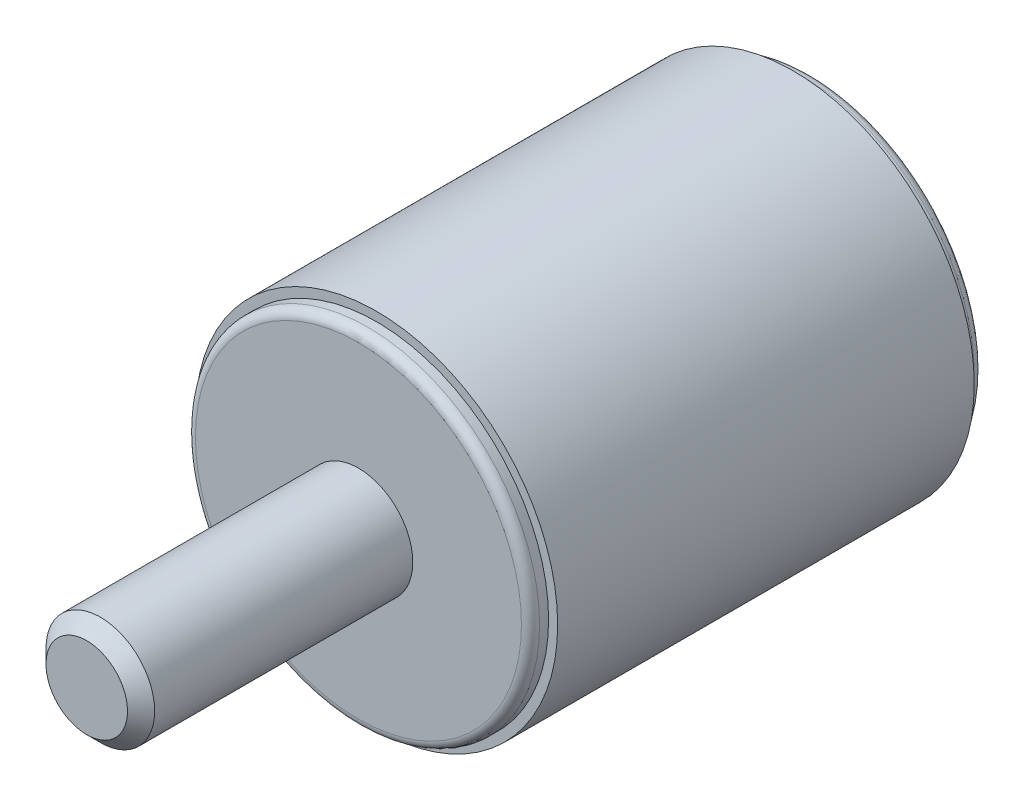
ISO-10303-21;
HEADER;
FILE_DESCRIPTION(('STEP AP214'),'2;1');
FILE_NAME('part.step','',(''),(''),'','','');
FILE_SCHEMA(('AUTOMOTIVE_DESIGN { 1 0 10303 214 1 1 1 1 }'));
ENDSEC;
DATA;
#1=APPLICATION_CONTEXT('core data for automotive mechanical design processes');
#2=APPLICATION_PROTOCOL_DEFINITION('international standard','automotive_design',2000,#1);
#3=PRODUCT_CONTEXT('',#1,'mechanical');
#4=PRODUCT('Part','Part','',(#3));
#5=PRODUCT_RELATED_PRODUCT_CATEGORY('part','',(#4));
#6=PRODUCT_DEFINITION_FORMATION('','',#4);
#7=PRODUCT_DEFINITION_CONTEXT('part definition',#1,'design');
#8=PRODUCT_DEFINITION('design','',#6,#7);
#9=PRODUCT_DEFINITION_SHAPE('','',#8);
#10=(LENGTH_UNIT() NAMED_UNIT(*) SI_UNIT(.MILLI.,.METRE.));
#11=(NAMED_UNIT(*) PLANE_ANGLE_UNIT() SI_UNIT($,.RADIAN.));
#12=(NAMED_UNIT(*) SI_UNIT($,.STERADIAN.) SOLID_ANGLE_UNIT());
#13=UNCERTAINTY_MEASURE_WITH_UNIT(LENGTH_MEASURE(1.E-05),#10,'distance_accuracy_value','');
#14=(GEOMETRIC_REPRESENTATION_CONTEXT(3) GLOBAL_UNCERTAINTY_ASSIGNED_CONTEXT((#13)) GLOBAL_UNIT_ASSIGNED_CONTEXT((#10,
#11,#12)) REPRESENTATION_CONTEXT('',''));
#15=CARTESIAN_POINT('',(0.,0.,0.));
#16=DIRECTION('',(0.,0.,1.));
#17=DIRECTION('',(1.,0.,0.));
#18=AXIS2_PLACEMENT_3D('',#15,#16,#17);
#19=CARTESIAN_POINT('',(0.,0.,24.));
#20=DIRECTION('',(0.,0.,1.));
#21=DIRECTION('',(1.,0.,0.));
#22=AXIS2_PLACEMENT_3D('',#19,#20,#21);
#23=PLANE('',#22);
#24=CARTESIAN_POINT('',(0.,0.,24.));
#25=DIRECTION('',(0.,0.,1.));
#26=DIRECTION('',(1.,0.,0.));
#27=AXIS2_PLACEMENT_3D('',#24,#25,#26);
#28=CIRCLE('',#27,9.);
#29=CARTESIAN_POINT('',(9.,0.,24.));
#30=VERTEX_POINT('',#29);
#31=EDGE_CURVE('E71',#30,#30,#28,.T.);
#32=ORIENTED_EDGE('',*,*,#31,.T.);
#33=EDGE_LOOP('',(#32));
#34=FACE_BOUND('',#33,.T.);
#35=CARTESIAN_POINT('',(0.,0.,24.));
#36=DIRECTION('',(0.,0.,1.));
#37=DIRECTION('',(1.,0.,0.));
#38=AXIS2_PLACEMENT_3D('',#35,#36,#37);
#39=CIRCLE('',#38,3.);
#40=CARTESIAN_POINT('',(3.,0.,24.));
#41=VERTEX_POINT('',#40);
#42=EDGE_CURVE('E48',#41,#41,#39,.T.);
#43=ORIENTED_EDGE('',*,*,#42,.F.);
#44=EDGE_LOOP('',(#43));
#45=FACE_BOUND('',#44,.T.);
#46=ADVANCED_FACE('F26',(#34,#45),#23,.T.);
#47=CARTESIAN_POINT('',(0.,0.,0.));
#48=DIRECTION('',(0.,0.,1.));
#49=DIRECTION('',(1.,0.,0.));
#50=AXIS2_PLACEMENT_3D('',#47,#48,#49);
#51=PLANE('',#50);
#52=CARTESIAN_POINT('',(0.,0.,0.));
#53=DIRECTION('',(0.,0.,1.));
#54=DIRECTION('',(1.,0.,0.));
#55=AXIS2_PLACEMENT_3D('',#52,#53,#54);
#56=CIRCLE('',#55,10.);
#57=CARTESIAN_POINT('',(10.,0.,0.));
#58=VERTEX_POINT('',#57);
#59=EDGE_CURVE('E56',#58,#58,#56,.T.);
#60=ORIENTED_EDGE('',*,*,#59,.F.);
#61=EDGE_LOOP('',(#60));
#62=FACE_BOUND('',#61,.T.);
#63=CARTESIAN_POINT('',(0.,0.,0.));
#64=DIRECTION('',(0.,0.,1.));
#65=DIRECTION('',(1.,0.,0.));
#66=AXIS2_PLACEMENT_3D('',#63,#64,#65);
#67=CIRCLE('',#66,9.5);
#68=CARTESIAN_POINT('',(9.5,0.,0.));
#69=VERTEX_POINT('',#68);
#70=EDGE_CURVE('E62',#69,#69,#67,.F.);
#71=ORIENTED_EDGE('',*,*,#70,.F.);
#72=EDGE_LOOP('',(#71));
#73=FACE_BOUND('',#72,.T.);
#74=ADVANCED_FACE('F95',(#62,#73),#51,.F.);
#75=CARTESIAN_POINT('',(0.,0.,23.));
#76=DIRECTION('',(0.,0.,1.));
#77=DIRECTION('',(1.,0.,0.));
#78=AXIS2_PLACEMENT_3D('',#75,#76,#77);
#79=PLANE('',#78);
#80=CARTESIAN_POINT('',(0.,0.,23.));
#81=DIRECTION('',(0.,0.,1.));
#82=DIRECTION('',(1.,0.,0.));
#83=AXIS2_PLACEMENT_3D('',#80,#81,#82);
#84=CIRCLE('',#83,10.);
#85=CARTESIAN_POINT('',(10.,0.,23.));
#86=VERTEX_POINT('',#85);
#87=EDGE_CURVE('E59',#86,#86,#84,.T.);
#88=ORIENTED_EDGE('',*,*,#87,.T.);
#89=EDGE_LOOP('',(#88));
#90=FACE_BOUND('',#89,.T.);
#91=CARTESIAN_POINT('',(0.,0.,23.));
#92=DIRECTION('',(0.,0.,1.));
#93=DIRECTION('',(1.,0.,0.));
#94=AXIS2_PLACEMENT_3D('',#91,#92,#93);
#95=CIRCLE('',#94,9.5);
#96=CARTESIAN_POINT('',(9.5,0.,23.));
#97=VERTEX_POINT('',#96);
#98=EDGE_CURVE('E53',#97,#97,#95,.T.);
#99=ORIENTED_EDGE('',*,*,#98,.F.);
#100=EDGE_LOOP('',(#99));
#101=FACE_BOUND('',#100,.T.);
#102=ADVANCED_FACE('F103',(#90,#101),#79,.T.);
#103=CARTESIAN_POINT('',(0.,0.,23.));
#104=DIRECTION('',(0.,0.,-1.));
#105=DIRECTION('',(-1.,0.,0.));
#106=AXIS2_PLACEMENT_3D('',#103,#104,#105);
#107=CYLINDRICAL_SURFACE('',#106,10.);
#108=ORIENTED_EDGE('',*,*,#87,.F.);
#109=EDGE_LOOP('',(#108));
#110=FACE_BOUND('',#109,.T.);
#111=ORIENTED_EDGE('',*,*,#59,.T.);
#112=EDGE_LOOP('',(#111));
#113=FACE_BOUND('',#112,.T.);
#114=ADVANCED_FACE('F28',(#110,#113),#107,.T.);
#115=CARTESIAN_POINT('',(0.,0.,24.));
#116=DIRECTION('',(0.,0.,-1.));
#117=DIRECTION('',(-1.,0.,0.));
#118=AXIS2_PLACEMENT_3D('',#115,#116,#117);
#119=CYLINDRICAL_SURFACE('',#118,9.5);
#120=CARTESIAN_POINT('',(0.,0.,23.5));
#121=DIRECTION('',(0.,0.,1.));
#122=DIRECTION('',(1.,0.,0.));
#123=AXIS2_PLACEMENT_3D('',#120,#121,#122);
#124=CIRCLE('',#123,9.5);
#125=CARTESIAN_POINT('',(9.5,0.,23.5));
#126=VERTEX_POINT('',#125);
#127=EDGE_CURVE('E74',#126,#126,#124,.F.);
#128=ORIENTED_EDGE('',*,*,#127,.T.);
#129=EDGE_LOOP('',(#128));
#130=FACE_BOUND('',#129,.T.);
#131=ORIENTED_EDGE('',*,*,#98,.T.);
#132=EDGE_LOOP('',(#131));
#133=FACE_BOUND('',#132,.T.);
#134=ADVANCED_FACE('F111',(#130,#133),#119,.T.);
#135=CARTESIAN_POINT('',(0.,0.,-1.));
#136=DIRECTION('',(0.,0.,1.));
#137=DIRECTION('',(1.,0.,0.));
#138=AXIS2_PLACEMENT_3D('',#135,#136,#137);
#139=CYLINDRICAL_SURFACE('',#138,9.5);
#140=CARTESIAN_POINT('',(0.,0.,-0.5));
#141=DIRECTION('',(0.,0.,-1.));
#142=DIRECTION('',(-1.,0.,0.));
#143=AXIS2_PLACEMENT_3D('',#140,#141,#142);
#144=CIRCLE('',#143,9.5);
#145=CARTESIAN_POINT('',(-9.5,0.,-0.5));
#146=VERTEX_POINT('',#145);
#147=EDGE_CURVE('E68',#146,#146,#144,.F.);
#148=ORIENTED_EDGE('',*,*,#147,.T.);
#149=EDGE_LOOP('',(#148));
#150=FACE_BOUND('',#149,.T.);
#151=ORIENTED_EDGE('',*,*,#70,.T.);
#152=EDGE_LOOP('',(#151));
#153=FACE_BOUND('',#152,.T.);
#154=ADVANCED_FACE('F109',(#150,#153),#139,.T.);
#155=CARTESIAN_POINT('',(0.,0.,-1.));
#156=DIRECTION('',(0.,0.,-1.));
#157=DIRECTION('',(-1.,0.,0.));
#158=AXIS2_PLACEMENT_3D('',#155,#156,#157);
#159=PLANE('',#158);
#160=CARTESIAN_POINT('',(0.,0.,-1.));
#161=DIRECTION('',(0.,0.,-1.));
#162=DIRECTION('',(-1.,0.,0.));
#163=AXIS2_PLACEMENT_3D('',#160,#161,#162);
#164=CIRCLE('',#163,3.);
#165=CARTESIAN_POINT('',(-3.,0.,-1.));
#166=VERTEX_POINT('',#165);
#167=EDGE_CURVE('E45',#166,#166,#164,.T.);
#168=ORIENTED_EDGE('',*,*,#167,.F.);
#169=EDGE_LOOP('',(#168));
#170=FACE_BOUND('',#169,.T.);
#171=CARTESIAN_POINT('',(0.,0.,-1.));
#172=DIRECTION('',(0.,0.,-1.));
#173=DIRECTION('',(-1.,0.,0.));
#174=AXIS2_PLACEMENT_3D('',#171,#172,#173);
#175=CIRCLE('',#174,9.);
#176=CARTESIAN_POINT('',(-9.,0.,-1.));
#177=VERTEX_POINT('',#176);
#178=EDGE_CURVE('E65',#177,#177,#175,.T.);
#179=ORIENTED_EDGE('',*,*,#178,.T.);
#180=EDGE_LOOP('',(#179));
#181=FACE_BOUND('',#180,.T.);
#182=ADVANCED_FACE('F130',(#170,#181),#159,.T.);
#183=CARTESIAN_POINT('',(0.,0.,-0.5));
#184=DIRECTION('',(0.,0.,-1.));
#185=DIRECTION('',(-1.,0.,0.));
#186=AXIS2_PLACEMENT_3D('',#183,#184,#185);
#187=TOROIDAL_SURFACE('',#186,9.,0.5);
#188=ORIENTED_EDGE('',*,*,#147,.F.);
#189=EDGE_LOOP('',(#188));
#190=FACE_BOUND('',#189,.T.);
#191=ORIENTED_EDGE('',*,*,#178,.F.);
#192=EDGE_LOOP('',(#191));
#193=FACE_BOUND('',#192,.T.);
#194=ADVANCED_FACE('F135',(#190,#193),#187,.T.);
#195=CARTESIAN_POINT('',(0.,0.,23.5));
#196=DIRECTION('',(0.,0.,1.));
#197=DIRECTION('',(1.,0.,0.));
#198=AXIS2_PLACEMENT_3D('',#195,#196,#197);
#199=TOROIDAL_SURFACE('',#198,9.,0.5);
#200=ORIENTED_EDGE('',*,*,#127,.F.);
#201=EDGE_LOOP('',(#200));
#202=FACE_BOUND('',#201,.T.);
#203=ORIENTED_EDGE('',*,*,#31,.F.);
#204=EDGE_LOOP('',(#203));
#205=FACE_BOUND('',#204,.T.);
#206=ADVANCED_FACE('F140',(#202,#205),#199,.T.);
#207=CARTESIAN_POINT('',(0.,0.,39.));
#208=DIRECTION('',(0.,0.,-1.));
#209=DIRECTION('',(-1.,0.,0.));
#210=AXIS2_PLACEMENT_3D('',#207,#208,#209);
#211=CYLINDRICAL_SURFACE('',#210,3.);
#212=CARTESIAN_POINT('',(0.,0.,38.25));
#213=DIRECTION('',(0.,0.,1.));
#214=DIRECTION('',(1.,0.,0.));
#215=AXIS2_PLACEMENT_3D('',#212,#213,#214);
#216=CIRCLE('',#215,3.);
#217=CARTESIAN_POINT('',(3.,0.,38.25));
#218=VERTEX_POINT('',#217);
#219=EDGE_CURVE('E11',#218,#218,#216,.F.);
#220=ORIENTED_EDGE('',*,*,#219,.T.);
#221=EDGE_LOOP('',(#220));
#222=FACE_BOUND('',#221,.T.);
#223=ORIENTED_EDGE('',*,*,#42,.T.);
#224=EDGE_LOOP('',(#223));
#225=FACE_BOUND('',#224,.T.);
#226=ADVANCED_FACE('F91',(#222,#225),#211,.T.);
#227=CARTESIAN_POINT('',(0.,0.,39.));
#228=DIRECTION('',(0.,0.,1.));
#229=DIRECTION('',(1.,0.,0.));
#230=AXIS2_PLACEMENT_3D('',#227,#228,#229);
#231=PLANE('',#230);
#232=CARTESIAN_POINT('',(0.,0.,39.));
#233=DIRECTION('',(0.,0.,1.));
#234=DIRECTION('',(1.,0.,0.));
#235=AXIS2_PLACEMENT_3D('',#232,#233,#234);
#236=CIRCLE('',#235,2.25);
#237=CARTESIAN_POINT('',(2.25,0.,39.));
#238=VERTEX_POINT('',#237);
#239=EDGE_CURVE('E33',#238,#238,#236,.T.);
#240=ORIENTED_EDGE('',*,*,#239,.T.);
#241=EDGE_LOOP('',(#240));
#242=FACE_BOUND('',#241,.T.);
#243=ADVANCED_FACE('F79',(#242),#231,.T.);
#244=CARTESIAN_POINT('',(0.,0.,39.));
#245=DIRECTION('',(0.,0.,-1.));
#246=DIRECTION('',(-1.,0.,0.));
#247=AXIS2_PLACEMENT_3D('',#244,#245,#246);
#248=CONICAL_SURFACE('',#247,2.25,0.785398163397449);
#249=ORIENTED_EDGE('',*,*,#219,.F.);
#250=EDGE_LOOP('',(#249));
#251=FACE_BOUND('',#250,.T.);
#252=ORIENTED_EDGE('',*,*,#239,.F.);
#253=EDGE_LOOP('',(#252));
#254=FACE_BOUND('',#253,.T.);
#255=ADVANCED_FACE('F81',(#251,#254),#248,.T.);
#256=CARTESIAN_POINT('',(0.,0.,4.));
#257=DIRECTION('',(0.,0.,-1.));
#258=DIRECTION('',(-1.,0.,0.));
#259=AXIS2_PLACEMENT_3D('',#256,#257,#258);
#260=CYLINDRICAL_SURFACE('',#259,3.);
#261=CARTESIAN_POINT('',(0.,0.,4.));
#262=DIRECTION('',(0.,0.,-1.));
#263=DIRECTION('',(-1.,0.,0.));
#264=AXIS2_PLACEMENT_3D('',#261,#262,#263);
#265=CIRCLE('',#264,3.);
#266=CARTESIAN_POINT('',(-3.,0.,4.));
#267=VERTEX_POINT('',#266);
#268=EDGE_CURVE('E43',#267,#267,#265,.T.);
#269=ORIENTED_EDGE('',*,*,#268,.F.);
#270=EDGE_LOOP('',(#269));
#271=FACE_BOUND('',#270,.T.);
#272=ORIENTED_EDGE('',*,*,#167,.T.);
#273=EDGE_LOOP('',(#272));
#274=FACE_BOUND('',#273,.T.);
#275=ADVANCED_FACE('F39',(#271,#274),#260,.F.);
#276=CARTESIAN_POINT('',(0.,0.,4.));
#277=DIRECTION('',(0.,0.,-1.));
#278=DIRECTION('',(-1.,0.,0.));
#279=AXIS2_PLACEMENT_3D('',#276,#277,#278);
#280=CONICAL_SURFACE('',#279,3.,1.0471975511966);
#281=CARTESIAN_POINT('',(0.,0.,5.73205080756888));
#282=VERTEX_POINT('',#281);
#283=VERTEX_LOOP('',#282);
#284=FACE_BOUND('',#283,.T.);
#285=ORIENTED_EDGE('',*,*,#268,.T.);
#286=EDGE_LOOP('',(#285));
#287=FACE_BOUND('',#286,.T.);
#288=ADVANCED_FACE('F36',(#284,#287),#280,.F.);
#289=CLOSED_SHELL('',(#46,#74,#102,#114,#134,#154,#182,#194,#206,#226,#243,#255,#275,#288));
#290=MANIFOLD_SOLID_BREP('B2',#289);
#291=ADVANCED_BREP_SHAPE_REPRESENTATION('',(#18,#290),#14);
#292=SHAPE_DEFINITION_REPRESENTATION(#9,#291);
ENDSEC;
END-ISO-10303-21;
